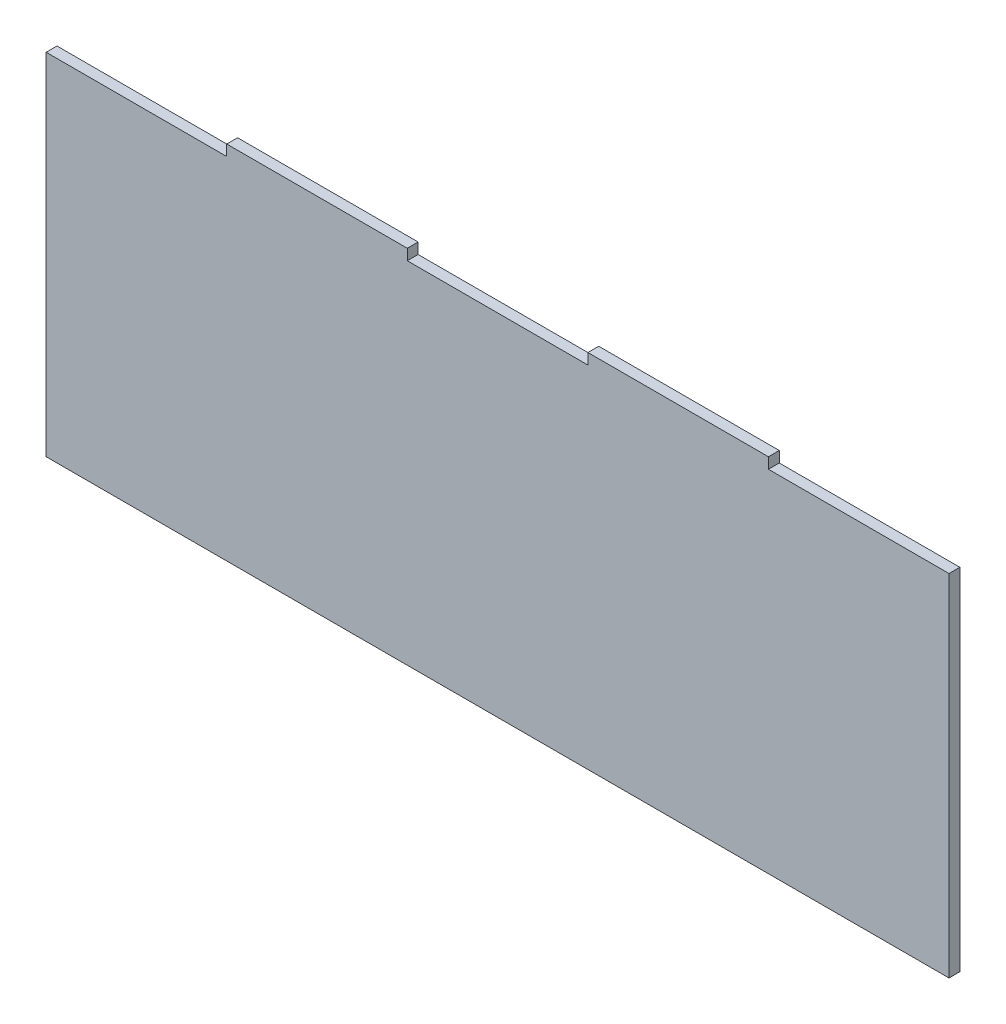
from build123d import *

# Parameters (mm, degrees)
BOSS_EXTRUDE1_DEPTH = 6


with BuildPart() as part:
    # Sketch1 → Boss-Extrude1 (new body)
    with BuildSketch(Plane.XY):
        Polygon((-516.914191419, 267.927392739), (-416.914191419, 267.927392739), (-416.914191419, 273.927392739), (-316.914191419, 273.927392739), (-316.914191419, 267.927392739), (-216.914191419, 267.927392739), (-216.914191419, 273.927392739), (-116.914191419, 273.927392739), (-116.914191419, 267.927392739), (-16.914191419, 267.927392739), (-16.914191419, 73.927392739), (-516.914191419, 73.927392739), align=None)
    extrude(amount=BOSS_EXTRUDE1_DEPTH)


solid = part.part
